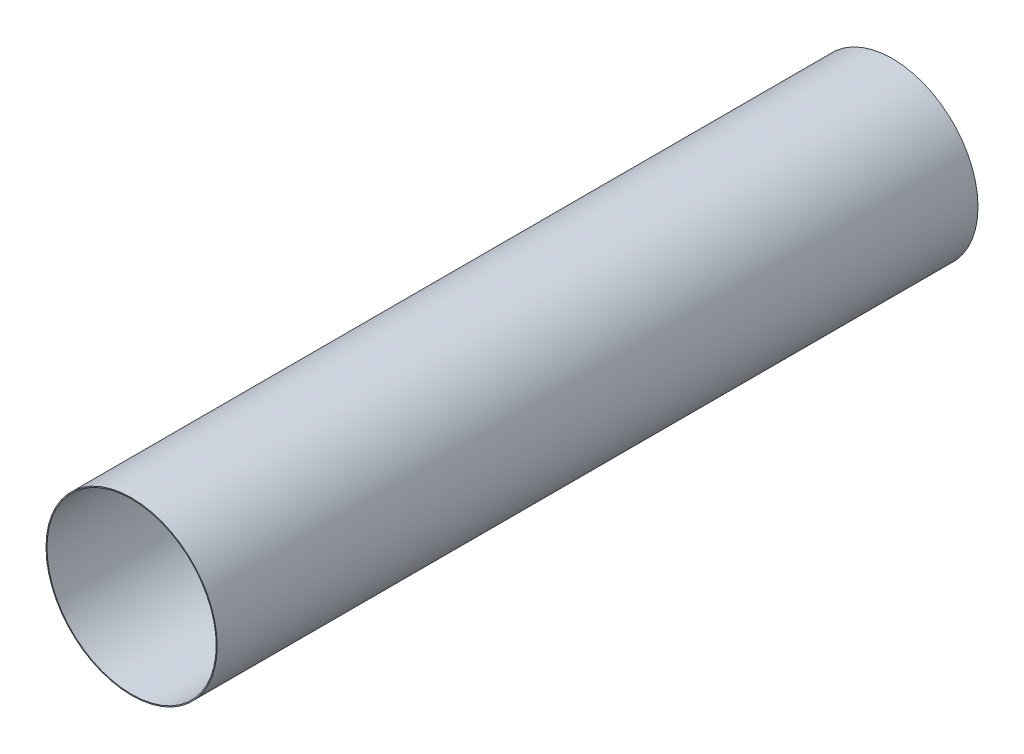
ISO-10303-21;
HEADER;
FILE_DESCRIPTION(('STEP AP214'),'2;1');
FILE_NAME('part.step','',(''),(''),'','','');
FILE_SCHEMA(('AUTOMOTIVE_DESIGN { 1 0 10303 214 1 1 1 1 }'));
ENDSEC;
DATA;
#1=APPLICATION_CONTEXT('core data for automotive mechanical design processes');
#2=APPLICATION_PROTOCOL_DEFINITION('international standard','automotive_design',2000,#1);
#3=PRODUCT_CONTEXT('',#1,'mechanical');
#4=PRODUCT('Part','Part','',(#3));
#5=PRODUCT_RELATED_PRODUCT_CATEGORY('part','',(#4));
#6=PRODUCT_DEFINITION_FORMATION('','',#4);
#7=PRODUCT_DEFINITION_CONTEXT('part definition',#1,'design');
#8=PRODUCT_DEFINITION('design','',#6,#7);
#9=PRODUCT_DEFINITION_SHAPE('','',#8);
#10=(LENGTH_UNIT() NAMED_UNIT(*) SI_UNIT(.MILLI.,.METRE.));
#11=(NAMED_UNIT(*) PLANE_ANGLE_UNIT() SI_UNIT($,.RADIAN.));
#12=(NAMED_UNIT(*) SI_UNIT($,.STERADIAN.) SOLID_ANGLE_UNIT());
#13=UNCERTAINTY_MEASURE_WITH_UNIT(LENGTH_MEASURE(1.E-05),#10,'distance_accuracy_value','');
#14=(GEOMETRIC_REPRESENTATION_CONTEXT(3) GLOBAL_UNCERTAINTY_ASSIGNED_CONTEXT((#13)) GLOBAL_UNIT_ASSIGNED_CONTEXT((#10,
#11,#12)) REPRESENTATION_CONTEXT('',''));
#15=CARTESIAN_POINT('',(0.,0.,0.));
#16=DIRECTION('',(0.,0.,1.));
#17=DIRECTION('',(1.,0.,0.));
#18=AXIS2_PLACEMENT_3D('',#15,#16,#17);
#19=CARTESIAN_POINT('',(0.,0.,800.));
#20=DIRECTION('',(0.,0.,1.));
#21=DIRECTION('',(1.,0.,0.));
#22=AXIS2_PLACEMENT_3D('',#19,#20,#21);
#23=PLANE('',#22);
#24=CARTESIAN_POINT('',(0.,0.,800.));
#25=DIRECTION('',(0.,0.,1.));
#26=DIRECTION('',(1.,0.,0.));
#27=AXIS2_PLACEMENT_3D('',#24,#25,#26);
#28=CIRCLE('',#27,90.);
#29=CARTESIAN_POINT('',(90.,0.,800.));
#30=VERTEX_POINT('',#29);
#31=EDGE_CURVE('E10',#30,#30,#28,.T.);
#32=ORIENTED_EDGE('',*,*,#31,.T.);
#33=EDGE_LOOP('',(#32));
#34=FACE_BOUND('',#33,.T.);
#35=CARTESIAN_POINT('',(0.,0.,800.));
#36=DIRECTION('',(0.,0.,1.));
#37=DIRECTION('',(1.,0.,0.));
#38=AXIS2_PLACEMENT_3D('',#35,#36,#37);
#39=CIRCLE('',#38,89.);
#40=CARTESIAN_POINT('',(89.,0.,800.));
#41=VERTEX_POINT('',#40);
#42=EDGE_CURVE('E43',#41,#41,#39,.T.);
#43=ORIENTED_EDGE('',*,*,#42,.F.);
#44=EDGE_LOOP('',(#43));
#45=FACE_BOUND('',#44,.T.);
#46=ADVANCED_FACE('F32',(#34,#45),#23,.T.);
#47=CARTESIAN_POINT('',(0.,0.,0.));
#48=DIRECTION('',(0.,0.,1.));
#49=DIRECTION('',(1.,0.,0.));
#50=AXIS2_PLACEMENT_3D('',#47,#48,#49);
#51=PLANE('',#50);
#52=CARTESIAN_POINT('',(0.,0.,0.));
#53=DIRECTION('',(0.,0.,1.));
#54=DIRECTION('',(1.,0.,0.));
#55=AXIS2_PLACEMENT_3D('',#52,#53,#54);
#56=CIRCLE('',#55,90.);
#57=CARTESIAN_POINT('',(90.,0.,0.));
#58=VERTEX_POINT('',#57);
#59=EDGE_CURVE('E36',#58,#58,#56,.T.);
#60=ORIENTED_EDGE('',*,*,#59,.F.);
#61=EDGE_LOOP('',(#60));
#62=FACE_BOUND('',#61,.T.);
#63=CARTESIAN_POINT('',(0.,0.,0.));
#64=DIRECTION('',(0.,0.,1.));
#65=DIRECTION('',(1.,0.,0.));
#66=AXIS2_PLACEMENT_3D('',#63,#64,#65);
#67=CIRCLE('',#66,89.);
#68=CARTESIAN_POINT('',(89.,0.,0.));
#69=VERTEX_POINT('',#68);
#70=EDGE_CURVE('E45',#69,#69,#67,.T.);
#71=ORIENTED_EDGE('',*,*,#70,.T.);
#72=EDGE_LOOP('',(#71));
#73=FACE_BOUND('',#72,.T.);
#74=ADVANCED_FACE('F55',(#62,#73),#51,.F.);
#75=CARTESIAN_POINT('',(0.,0.,800.));
#76=DIRECTION('',(0.,0.,-1.));
#77=DIRECTION('',(-1.,0.,0.));
#78=AXIS2_PLACEMENT_3D('',#75,#76,#77);
#79=CYLINDRICAL_SURFACE('',#78,90.);
#80=ORIENTED_EDGE('',*,*,#31,.F.);
#81=EDGE_LOOP('',(#80));
#82=FACE_BOUND('',#81,.T.);
#83=ORIENTED_EDGE('',*,*,#59,.T.);
#84=EDGE_LOOP('',(#83));
#85=FACE_BOUND('',#84,.T.);
#86=ADVANCED_FACE('F34',(#82,#85),#79,.T.);
#87=CARTESIAN_POINT('',(0.,0.,800.));
#88=DIRECTION('',(0.,0.,-1.));
#89=DIRECTION('',(-1.,0.,0.));
#90=AXIS2_PLACEMENT_3D('',#87,#88,#89);
#91=CYLINDRICAL_SURFACE('',#90,89.);
#92=ORIENTED_EDGE('',*,*,#42,.T.);
#93=EDGE_LOOP('',(#92));
#94=FACE_BOUND('',#93,.T.);
#95=ORIENTED_EDGE('',*,*,#70,.F.);
#96=EDGE_LOOP('',(#95));
#97=FACE_BOUND('',#96,.T.);
#98=ADVANCED_FACE('F51',(#94,#97),#91,.F.);
#99=CLOSED_SHELL('',(#46,#74,#86,#98));
#100=MANIFOLD_SOLID_BREP('B2',#99);
#101=ADVANCED_BREP_SHAPE_REPRESENTATION('',(#18,#100),#14);
#102=SHAPE_DEFINITION_REPRESENTATION(#9,#101);
ENDSEC;
END-ISO-10303-21;
